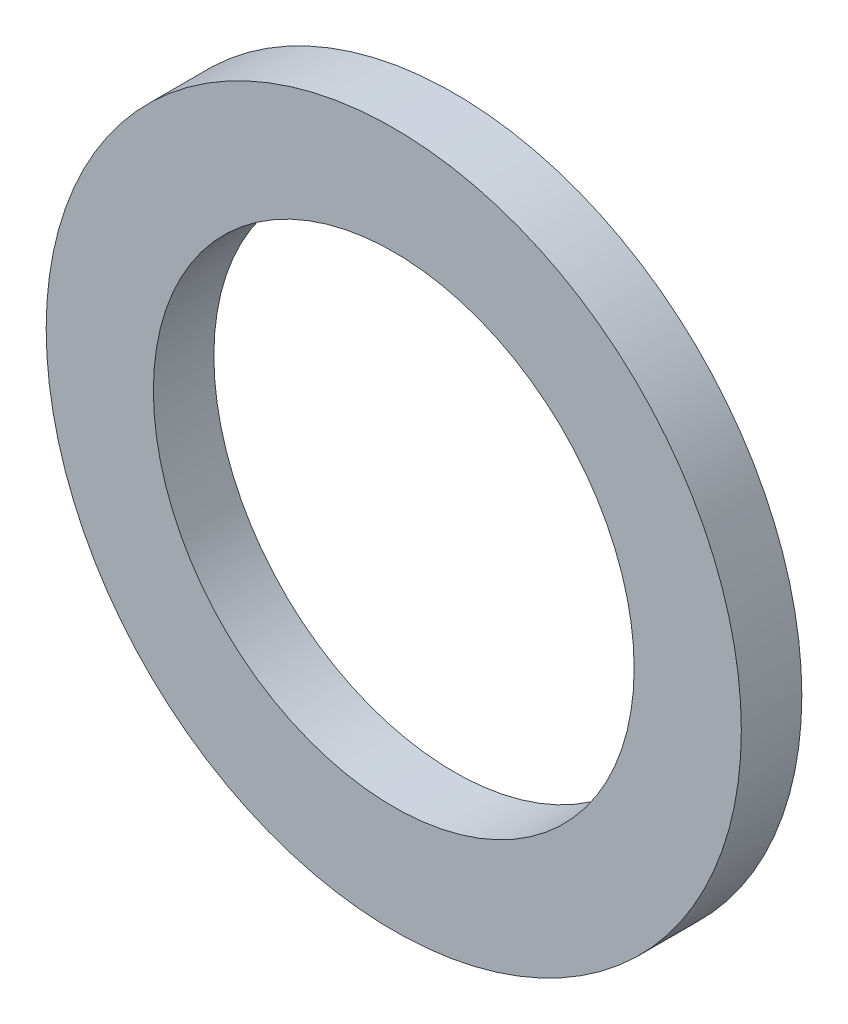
from build123d import *

# Parameters (mm, degrees)
SKETCH_1_R      = 4.54
SKETCH_1_R_2    = 3.14
EXTRUDE_1_DEPTH = 0.79


with BuildPart() as part:
    # Sketch 1 → Extrude 1 (new body)
    with BuildSketch(Plane.XY):
        with Locations(Location((0, 0, 0), (0, 0, 180))):
            Circle(SKETCH_1_R)
        with Locations(Location((0, 0, 0), (0, 0, 180))):
            Circle(SKETCH_1_R_2, mode=Mode.SUBTRACT)
    extrude(amount=EXTRUDE_1_DEPTH)


solid = part.part
